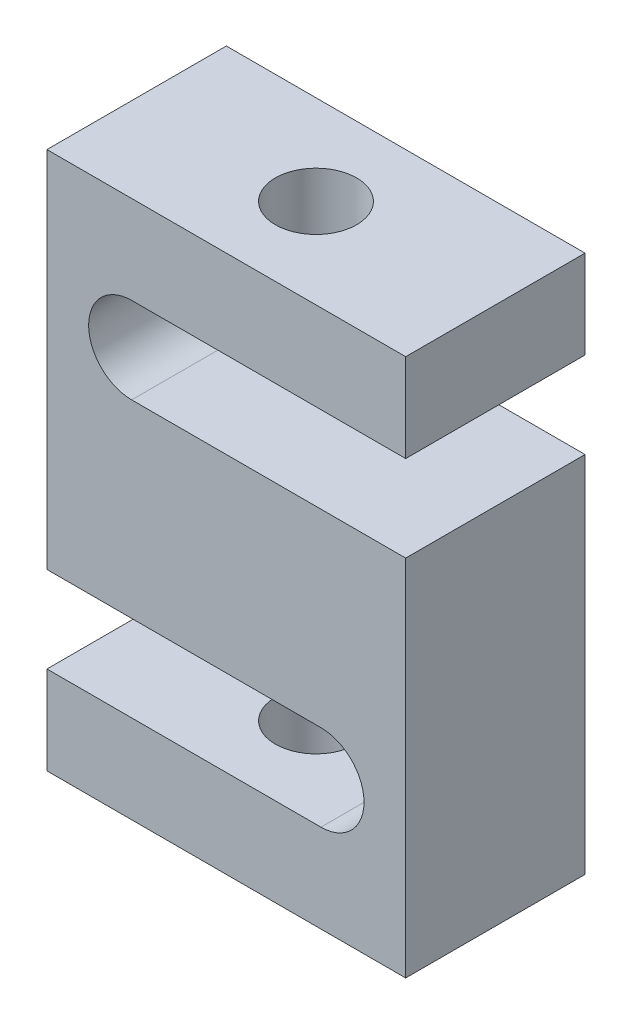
from build123d import *

# Parameters (mm, degrees)
BOSS_EXTRUDE1_DEPTH          = 12.7
F_1_2_20_TAPPED_HOLE1_REACH  = 83.32
F_1_2_20_TAPPED_HOLE1_BORE_R = 5.75437


with BuildPart() as part:
    # Sketch2 → Boss-Extrude1 (new, symmetric)
    with BuildSketch(Plane.XY):
        with BuildLine():
            Line((-25.4, 38.1), (25.4, 38.1))
            Line((25.4, 38.1), (25.4, 25.6))
            Line((25.4, 25.6), (-13.4, 25.6))
            ThreePointArc((-13.4, 25.6), (-19.5, 19.5), (-13.4, 13.4))
            Line((-13.4, 13.4), (25.4, 13.4))
            Line((25.4, 13.4), (25.4, -38.1))
            Line((25.4, -38.1), (-25.4, -38.1))
            Line((-25.4, -38.1), (-25.4, -25.6))
            Line((-25.4, -25.6), (13.4, -25.6))
            ThreePointArc((13.4, -25.6), (19.5, -19.5), (13.4, -13.4))
            Line((13.4, -13.4), (-25.4, -13.4))
            Line((-25.4, -13.4), (-25.4, 38.1))
        make_face()
    extrude(amount=BOSS_EXTRUDE1_DEPTH, both=True)

    # 1_2-20 Tapped Hole1 bore → 1_2-20 Tapped Hole1 (cut, up to next)
    with BuildSketch(Plane(origin=(0, 38.1, 0), x_dir=(1, 0, 0), z_dir=(0, 1, 0)), mode=Mode.PRIVATE) as f_1_2_20_tapped_hole1_sk1:
        Circle(F_1_2_20_TAPPED_HOLE1_BORE_R)
    f_1_2_20_tapped_hole1_tool1 = extrude(f_1_2_20_tapped_hole1_sk1.sketch, amount=-F_1_2_20_TAPPED_HOLE1_REACH, mode=Mode.PRIVATE) & part.part
    f_1_2_20_tapped_hole1 = f_1_2_20_tapped_hole1_tool1.solids().sort_by_distance((0, 38.1, 0))[0]
    add(f_1_2_20_tapped_hole1, mode=Mode.SUBTRACT)

    # Mirror1: 1_2-20 Tapped Hole1 across plane
    add(f_1_2_20_tapped_hole1.mirror(Plane.ZX), mode=Mode.SUBTRACT)


solid = part.part
